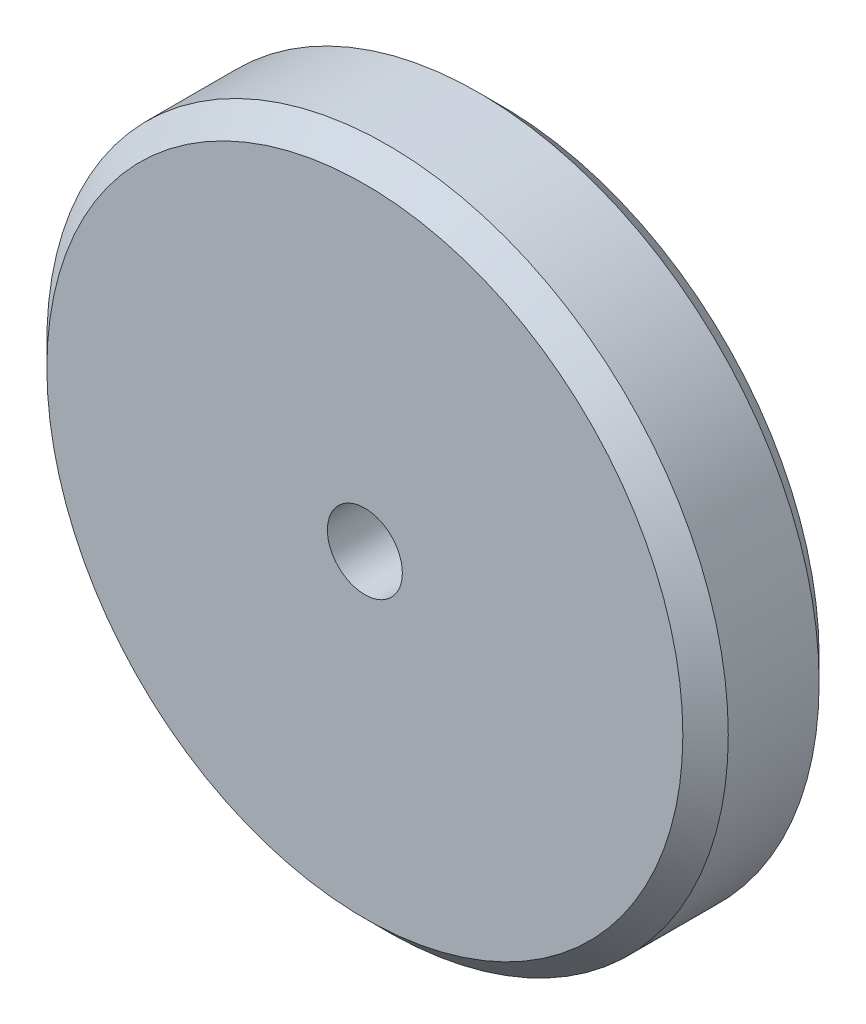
from build123d import *

# Parameters (mm, degrees)
SKETCH1_R         = 15
EXTRUDE1_DEPTH    = 6
M4_TAPPED_HOLE1_D = 3.3
CHAMFER1_SIZE     = 1


with BuildPart() as part:
    # Sketch1 → Extrude1 (new body)
    with BuildSketch(Plane.XY):
        Circle(SKETCH1_R)
    extrude(amount=EXTRUDE1_DEPTH)

    # M4 Tapped Hole1 (through all)
    with Locations(Plane.XY.offset(6)):
        with Locations((0, 0)):
            Hole(M4_TAPPED_HOLE1_D / 2)

    # Chamfer1
    chamfer1_edges = [part.edges().sort_by_distance(p)[0] for p in [
        (-15, 0, 0),
        (-15, 0, 6),
    ]]
    chamfer(chamfer1_edges, length=CHAMFER1_SIZE)


solid = part.part
